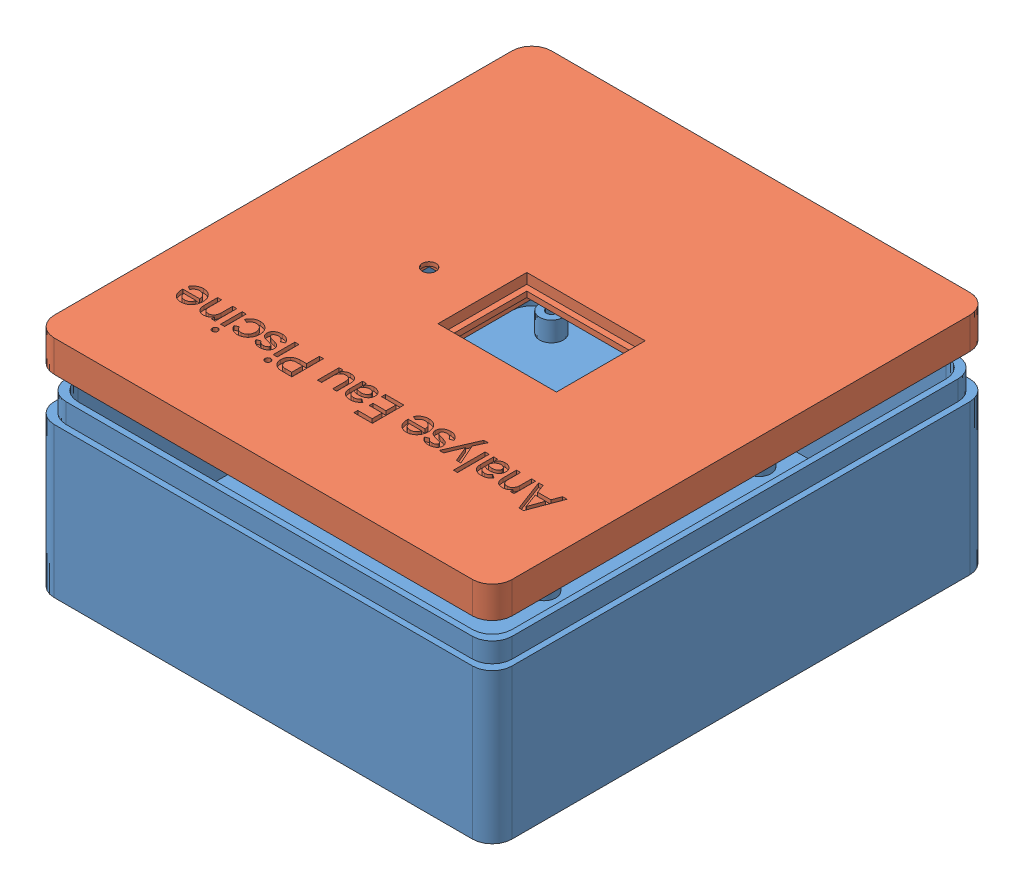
SolidWorks assembly Assem1.sldasm, configuration Default (file format 13000). Lengths in mm.
Overall size (116 56.98 126).
2 component instances, 2 part files, 2 mates.
Components (placement in the parent):
- Boite-1: Boite.SLDPRT [Default] at (35.6746 52.6509 111.611) size (116 43 126)
- Couvercle-1: Couvercle.SLDPRT [Default] at (35.6746 106.632 111.611) x (-1 0 0) z (0 0 1) size (116 8 126)
Mates (geometry in assembly coordinates):
- Coincident6: coincident anti-aligned: plane of Boite-1 through (92.1746 87.6509 173.111) normal (0 0 1); plane of Couvercle-1 through (-20.8254 98.632 173.111) normal (0 0 -1)
- Coincident7: coincident anti-aligned: plane of Boite-1 through (-20.8254 87.6509 173.111) normal (-1 0 0); plane of Couvercle-1 through (-20.8254 98.632 173.111) normal (1 0 0)
